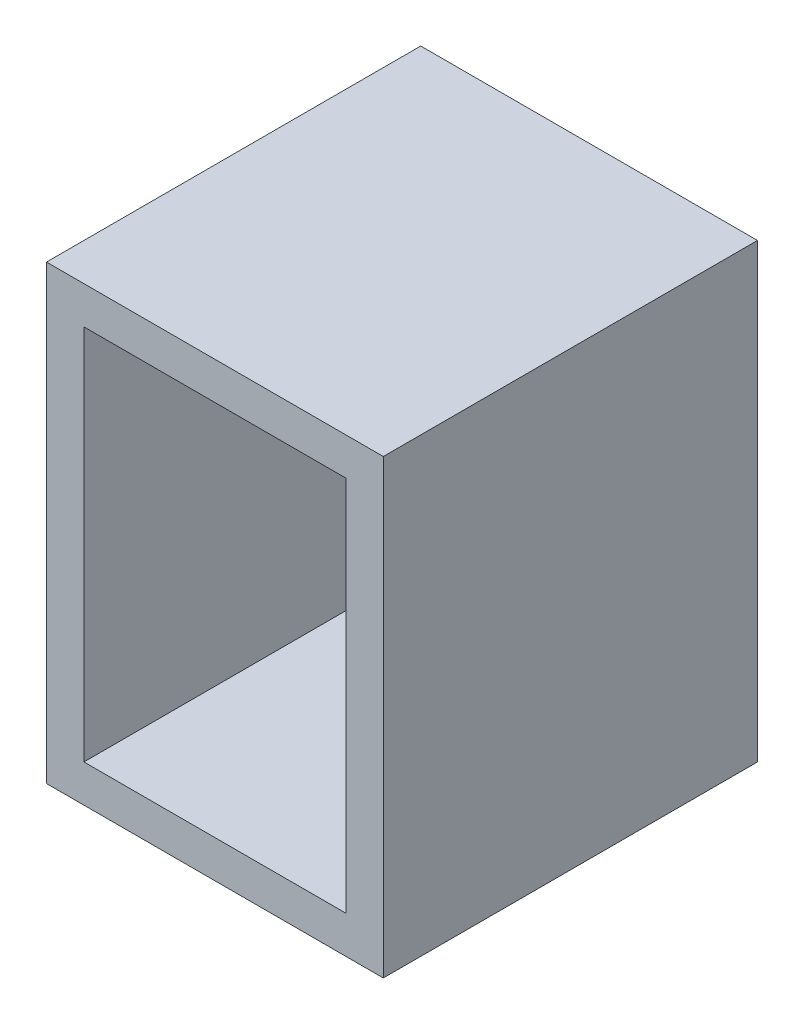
ISO-10303-21;
HEADER;
FILE_DESCRIPTION(('STEP AP214'),'2;1');
FILE_NAME('part.step','',(''),(''),'','','');
FILE_SCHEMA(('AUTOMOTIVE_DESIGN { 1 0 10303 214 1 1 1 1 }'));
ENDSEC;
DATA;
#1=APPLICATION_CONTEXT('core data for automotive mechanical design processes');
#2=APPLICATION_PROTOCOL_DEFINITION('international standard','automotive_design',2000,#1);
#3=PRODUCT_CONTEXT('',#1,'mechanical');
#4=PRODUCT('Part','Part','',(#3));
#5=PRODUCT_RELATED_PRODUCT_CATEGORY('part','',(#4));
#6=PRODUCT_DEFINITION_FORMATION('','',#4);
#7=PRODUCT_DEFINITION_CONTEXT('part definition',#1,'design');
#8=PRODUCT_DEFINITION('design','',#6,#7);
#9=PRODUCT_DEFINITION_SHAPE('','',#8);
#10=(LENGTH_UNIT() NAMED_UNIT(*) SI_UNIT(.MILLI.,.METRE.));
#11=(NAMED_UNIT(*) PLANE_ANGLE_UNIT() SI_UNIT($,.RADIAN.));
#12=(NAMED_UNIT(*) SI_UNIT($,.STERADIAN.) SOLID_ANGLE_UNIT());
#13=UNCERTAINTY_MEASURE_WITH_UNIT(LENGTH_MEASURE(1.E-05),#10,'distance_accuracy_value','');
#14=(GEOMETRIC_REPRESENTATION_CONTEXT(3) GLOBAL_UNCERTAINTY_ASSIGNED_CONTEXT((#13)) GLOBAL_UNIT_ASSIGNED_CONTEXT((#10,
#11,#12)) REPRESENTATION_CONTEXT('',''));
#15=CARTESIAN_POINT('',(0.,0.,0.));
#16=DIRECTION('',(0.,0.,1.));
#17=DIRECTION('',(1.,0.,0.));
#18=AXIS2_PLACEMENT_3D('',#15,#16,#17);
#19=CARTESIAN_POINT('',(-22.5,25.173,25.));
#20=DIRECTION('',(1.,0.,0.));
#21=DIRECTION('',(0.,1.,0.));
#22=AXIS2_PLACEMENT_3D('',#19,#20,#21);
#23=PLANE('',#22);
#24=DIRECTION('',(0.,-1.,0.));
#25=VECTOR('',#24,1.);
#26=CARTESIAN_POINT('',(-22.5,25.173,-25.));
#27=LINE('',#26,#25);
#28=CARTESIAN_POINT('',(-22.5,30.173,-25.));
#29=VERTEX_POINT('',#28);
#30=CARTESIAN_POINT('',(-22.5,-30.173,-25.));
#31=VERTEX_POINT('',#30);
#32=EDGE_CURVE('E118',#29,#31,#27,.T.);
#33=ORIENTED_EDGE('',*,*,#32,.T.);
#34=DIRECTION('',(0.,0.,-1.));
#35=VECTOR('',#34,1.);
#36=CARTESIAN_POINT('',(-22.5,-30.173,25.));
#37=LINE('',#36,#35);
#38=CARTESIAN_POINT('',(-22.5,-30.173,25.));
#39=VERTEX_POINT('',#38);
#40=EDGE_CURVE('E11',#39,#31,#37,.T.);
#41=ORIENTED_EDGE('',*,*,#40,.F.);
#42=DIRECTION('',(0.,-1.,0.));
#43=VECTOR('',#42,1.);
#44=CARTESIAN_POINT('',(-22.5,25.173,25.));
#45=LINE('',#44,#43);
#46=CARTESIAN_POINT('',(-22.5,30.173,25.));
#47=VERTEX_POINT('',#46);
#48=EDGE_CURVE('E152',#47,#39,#45,.T.);
#49=ORIENTED_EDGE('',*,*,#48,.F.);
#50=DIRECTION('',(0.,0.,-1.));
#51=VECTOR('',#50,1.);
#52=CARTESIAN_POINT('',(-22.5,30.173,25.));
#53=LINE('',#52,#51);
#54=EDGE_CURVE('E139',#47,#29,#53,.T.);
#55=ORIENTED_EDGE('',*,*,#54,.T.);
#56=EDGE_LOOP('',(#33,#41,#49,#55));
#57=FACE_BOUND('',#56,.T.);
#58=ADVANCED_FACE('F32',(#57),#23,.F.);
#59=CARTESIAN_POINT('',(-17.5,-30.173,25.));
#60=DIRECTION('',(0.,1.,0.));
#61=DIRECTION('',(-1.,0.,0.));
#62=AXIS2_PLACEMENT_3D('',#59,#60,#61);
#63=PLANE('',#62);
#64=DIRECTION('',(1.,0.,0.));
#65=VECTOR('',#64,1.);
#66=CARTESIAN_POINT('',(-17.5,-30.173,-25.));
#67=LINE('',#66,#65);
#68=CARTESIAN_POINT('',(22.5,-30.173,-25.));
#69=VERTEX_POINT('',#68);
#70=EDGE_CURVE('E149',#31,#69,#67,.T.);
#71=ORIENTED_EDGE('',*,*,#70,.T.);
#72=DIRECTION('',(0.,0.,-1.));
#73=VECTOR('',#72,1.);
#74=CARTESIAN_POINT('',(22.5,-30.173,25.));
#75=LINE('',#74,#73);
#76=CARTESIAN_POINT('',(22.5,-30.173,25.));
#77=VERTEX_POINT('',#76);
#78=EDGE_CURVE('E41',#77,#69,#75,.T.);
#79=ORIENTED_EDGE('',*,*,#78,.F.);
#80=DIRECTION('',(1.,0.,0.));
#81=VECTOR('',#80,1.);
#82=CARTESIAN_POINT('',(-17.5,-30.173,25.));
#83=LINE('',#82,#81);
#84=EDGE_CURVE('E158',#39,#77,#83,.T.);
#85=ORIENTED_EDGE('',*,*,#84,.F.);
#86=ORIENTED_EDGE('',*,*,#40,.T.);
#87=EDGE_LOOP('',(#71,#79,#85,#86));
#88=FACE_BOUND('',#87,.T.);
#89=ADVANCED_FACE('F171',(#88),#63,.F.);
#90=CARTESIAN_POINT('',(22.5,25.173,25.));
#91=DIRECTION('',(-1.,0.,0.));
#92=DIRECTION('',(0.,-1.,0.));
#93=AXIS2_PLACEMENT_3D('',#90,#91,#92);
#94=PLANE('',#93);
#95=DIRECTION('',(0.,1.,0.));
#96=VECTOR('',#95,1.);
#97=CARTESIAN_POINT('',(22.5,25.173,-25.));
#98=LINE('',#97,#96);
#99=CARTESIAN_POINT('',(22.5,30.173,-25.));
#100=VERTEX_POINT('',#99);
#101=EDGE_CURVE('E153',#69,#100,#98,.T.);
#102=ORIENTED_EDGE('',*,*,#101,.T.);
#103=DIRECTION('',(0.,0.,-1.));
#104=VECTOR('',#103,1.);
#105=CARTESIAN_POINT('',(22.5,30.173,25.));
#106=LINE('',#105,#104);
#107=CARTESIAN_POINT('',(22.5,30.173,25.));
#108=VERTEX_POINT('',#107);
#109=EDGE_CURVE('E142',#108,#100,#106,.T.);
#110=ORIENTED_EDGE('',*,*,#109,.F.);
#111=DIRECTION('',(0.,1.,0.));
#112=VECTOR('',#111,1.);
#113=CARTESIAN_POINT('',(22.5,25.173,25.));
#114=LINE('',#113,#112);
#115=EDGE_CURVE('E159',#77,#108,#114,.T.);
#116=ORIENTED_EDGE('',*,*,#115,.F.);
#117=ORIENTED_EDGE('',*,*,#78,.T.);
#118=EDGE_LOOP('',(#102,#110,#116,#117));
#119=FACE_BOUND('',#118,.T.);
#120=ADVANCED_FACE('F175',(#119),#94,.F.);
#121=CARTESIAN_POINT('',(-17.5,30.173,25.));
#122=DIRECTION('',(0.,-1.,0.));
#123=DIRECTION('',(0.,0.,-1.));
#124=AXIS2_PLACEMENT_3D('',#121,#122,#123);
#125=PLANE('',#124);
#126=DIRECTION('',(-1.,0.,0.));
#127=VECTOR('',#126,1.);
#128=CARTESIAN_POINT('',(-17.5,30.173,-25.));
#129=LINE('',#128,#127);
#130=EDGE_CURVE('E150',#100,#29,#129,.T.);
#131=ORIENTED_EDGE('',*,*,#130,.T.);
#132=ORIENTED_EDGE('',*,*,#54,.F.);
#133=DIRECTION('',(-1.,0.,0.));
#134=VECTOR('',#133,1.);
#135=CARTESIAN_POINT('',(-17.5,30.173,25.));
#136=LINE('',#135,#134);
#137=EDGE_CURVE('E36',#108,#47,#136,.T.);
#138=ORIENTED_EDGE('',*,*,#137,.F.);
#139=ORIENTED_EDGE('',*,*,#109,.T.);
#140=EDGE_LOOP('',(#131,#132,#138,#139));
#141=FACE_BOUND('',#140,.T.);
#142=ADVANCED_FACE('F34',(#141),#125,.F.);
#143=CARTESIAN_POINT('',(-17.5,-25.173,25.));
#144=DIRECTION('',(0.,0.,1.));
#145=DIRECTION('',(1.,0.,0.));
#146=AXIS2_PLACEMENT_3D('',#143,#144,#145);
#147=PLANE('',#146);
#148=DIRECTION('',(0.,-1.,0.));
#149=VECTOR('',#148,1.);
#150=CARTESIAN_POINT('',(-17.5,25.173,25.));
#151=LINE('',#150,#149);
#152=CARTESIAN_POINT('',(-17.5,25.173,25.));
#153=VERTEX_POINT('',#152);
#154=CARTESIAN_POINT('',(-17.5,-25.173,25.));
#155=VERTEX_POINT('',#154);
#156=EDGE_CURVE('E101',#153,#155,#151,.T.);
#157=ORIENTED_EDGE('',*,*,#156,.F.);
#158=DIRECTION('',(-1.,0.,0.));
#159=VECTOR('',#158,1.);
#160=CARTESIAN_POINT('',(-17.5,25.173,25.));
#161=LINE('',#160,#159);
#162=CARTESIAN_POINT('',(17.5,25.173,25.));
#163=VERTEX_POINT('',#162);
#164=EDGE_CURVE('E126',#163,#153,#161,.T.);
#165=ORIENTED_EDGE('',*,*,#164,.F.);
#166=DIRECTION('',(0.,1.,0.));
#167=VECTOR('',#166,1.);
#168=CARTESIAN_POINT('',(17.5,25.173,25.));
#169=LINE('',#168,#167);
#170=CARTESIAN_POINT('',(17.5,-25.173,25.));
#171=VERTEX_POINT('',#170);
#172=EDGE_CURVE('E124',#171,#163,#169,.T.);
#173=ORIENTED_EDGE('',*,*,#172,.F.);
#174=DIRECTION('',(1.,0.,0.));
#175=VECTOR('',#174,1.);
#176=CARTESIAN_POINT('',(-17.5,-25.173,25.));
#177=LINE('',#176,#175);
#178=EDGE_CURVE('E111',#155,#171,#177,.T.);
#179=ORIENTED_EDGE('',*,*,#178,.F.);
#180=EDGE_LOOP('',(#157,#165,#173,#179));
#181=FACE_BOUND('',#180,.T.);
#182=ORIENTED_EDGE('',*,*,#48,.T.);
#183=ORIENTED_EDGE('',*,*,#84,.T.);
#184=ORIENTED_EDGE('',*,*,#115,.T.);
#185=ORIENTED_EDGE('',*,*,#137,.T.);
#186=EDGE_LOOP('',(#182,#183,#184,#185));
#187=FACE_BOUND('',#186,.T.);
#188=ADVANCED_FACE('F122',(#181,#187),#147,.T.);
#189=CARTESIAN_POINT('',(-17.5,-25.173,-25.));
#190=DIRECTION('',(0.,0.,1.));
#191=DIRECTION('',(1.,0.,0.));
#192=AXIS2_PLACEMENT_3D('',#189,#190,#191);
#193=PLANE('',#192);
#194=DIRECTION('',(-1.,0.,0.));
#195=VECTOR('',#194,1.);
#196=CARTESIAN_POINT('',(-17.5,25.173,-25.));
#197=LINE('',#196,#195);
#198=CARTESIAN_POINT('',(17.5,25.173,-25.));
#199=VERTEX_POINT('',#198);
#200=CARTESIAN_POINT('',(-17.5,25.173,-25.));
#201=VERTEX_POINT('',#200);
#202=EDGE_CURVE('E112',#199,#201,#197,.T.);
#203=ORIENTED_EDGE('',*,*,#202,.T.);
#204=DIRECTION('',(0.,-1.,0.));
#205=VECTOR('',#204,1.);
#206=CARTESIAN_POINT('',(-17.5,25.173,-25.));
#207=LINE('',#206,#205);
#208=CARTESIAN_POINT('',(-17.5,-25.173,-25.));
#209=VERTEX_POINT('',#208);
#210=EDGE_CURVE('E130',#201,#209,#207,.T.);
#211=ORIENTED_EDGE('',*,*,#210,.T.);
#212=DIRECTION('',(1.,0.,0.));
#213=VECTOR('',#212,1.);
#214=CARTESIAN_POINT('',(-17.5,-25.173,-25.));
#215=LINE('',#214,#213);
#216=CARTESIAN_POINT('',(17.5,-25.173,-25.));
#217=VERTEX_POINT('',#216);
#218=EDGE_CURVE('E117',#209,#217,#215,.T.);
#219=ORIENTED_EDGE('',*,*,#218,.T.);
#220=DIRECTION('',(0.,1.,0.));
#221=VECTOR('',#220,1.);
#222=CARTESIAN_POINT('',(17.5,25.173,-25.));
#223=LINE('',#222,#221);
#224=EDGE_CURVE('E56',#217,#199,#223,.T.);
#225=ORIENTED_EDGE('',*,*,#224,.T.);
#226=EDGE_LOOP('',(#203,#211,#219,#225));
#227=FACE_BOUND('',#226,.T.);
#228=ORIENTED_EDGE('',*,*,#32,.F.);
#229=ORIENTED_EDGE('',*,*,#130,.F.);
#230=ORIENTED_EDGE('',*,*,#101,.F.);
#231=ORIENTED_EDGE('',*,*,#70,.F.);
#232=EDGE_LOOP('',(#228,#229,#230,#231));
#233=FACE_BOUND('',#232,.T.);
#234=ADVANCED_FACE('F177',(#227,#233),#193,.F.);
#235=CARTESIAN_POINT('',(-17.5,25.173,25.));
#236=DIRECTION('',(1.,0.,0.));
#237=DIRECTION('',(0.,1.,0.));
#238=AXIS2_PLACEMENT_3D('',#235,#236,#237);
#239=PLANE('',#238);
#240=ORIENTED_EDGE('',*,*,#210,.F.);
#241=DIRECTION('',(0.,0.,-1.));
#242=VECTOR('',#241,1.);
#243=CARTESIAN_POINT('',(-17.5,25.173,25.));
#244=LINE('',#243,#242);
#245=EDGE_CURVE('E107',#153,#201,#244,.T.);
#246=ORIENTED_EDGE('',*,*,#245,.F.);
#247=ORIENTED_EDGE('',*,*,#156,.T.);
#248=DIRECTION('',(0.,0.,-1.));
#249=VECTOR('',#248,1.);
#250=CARTESIAN_POINT('',(-17.5,-25.173,25.));
#251=LINE('',#250,#249);
#252=EDGE_CURVE('E105',#155,#209,#251,.T.);
#253=ORIENTED_EDGE('',*,*,#252,.T.);
#254=EDGE_LOOP('',(#240,#246,#247,#253));
#255=FACE_BOUND('',#254,.T.);
#256=ADVANCED_FACE('F104',(#255),#239,.T.);
#257=CARTESIAN_POINT('',(-17.5,-25.173,25.));
#258=DIRECTION('',(0.,1.,0.));
#259=DIRECTION('',(-1.,0.,0.));
#260=AXIS2_PLACEMENT_3D('',#257,#258,#259);
#261=PLANE('',#260);
#262=ORIENTED_EDGE('',*,*,#218,.F.);
#263=ORIENTED_EDGE('',*,*,#252,.F.);
#264=ORIENTED_EDGE('',*,*,#178,.T.);
#265=DIRECTION('',(0.,0.,-1.));
#266=VECTOR('',#265,1.);
#267=CARTESIAN_POINT('',(17.5,-25.173,25.));
#268=LINE('',#267,#266);
#269=EDGE_CURVE('E119',#171,#217,#268,.T.);
#270=ORIENTED_EDGE('',*,*,#269,.T.);
#271=EDGE_LOOP('',(#262,#263,#264,#270));
#272=FACE_BOUND('',#271,.T.);
#273=ADVANCED_FACE('F115',(#272),#261,.T.);
#274=CARTESIAN_POINT('',(17.5,25.173,25.));
#275=DIRECTION('',(-1.,0.,0.));
#276=DIRECTION('',(0.,-1.,0.));
#277=AXIS2_PLACEMENT_3D('',#274,#275,#276);
#278=PLANE('',#277);
#279=ORIENTED_EDGE('',*,*,#224,.F.);
#280=ORIENTED_EDGE('',*,*,#269,.F.);
#281=ORIENTED_EDGE('',*,*,#172,.T.);
#282=DIRECTION('',(0.,0.,-1.));
#283=VECTOR('',#282,1.);
#284=CARTESIAN_POINT('',(17.5,25.173,25.));
#285=LINE('',#284,#283);
#286=EDGE_CURVE('E49',#163,#199,#285,.T.);
#287=ORIENTED_EDGE('',*,*,#286,.T.);
#288=EDGE_LOOP('',(#279,#280,#281,#287));
#289=FACE_BOUND('',#288,.T.);
#290=ADVANCED_FACE('F222',(#289),#278,.T.);
#291=CARTESIAN_POINT('',(-17.5,25.173,25.));
#292=DIRECTION('',(0.,-1.,0.));
#293=DIRECTION('',(0.,0.,-1.));
#294=AXIS2_PLACEMENT_3D('',#291,#292,#293);
#295=PLANE('',#294);
#296=ORIENTED_EDGE('',*,*,#202,.F.);
#297=ORIENTED_EDGE('',*,*,#286,.F.);
#298=ORIENTED_EDGE('',*,*,#164,.T.);
#299=ORIENTED_EDGE('',*,*,#245,.T.);
#300=EDGE_LOOP('',(#296,#297,#298,#299));
#301=FACE_BOUND('',#300,.T.);
#302=ADVANCED_FACE('F231',(#301),#295,.T.);
#303=CLOSED_SHELL('',(#58,#89,#120,#142,#188,#234,#256,#273,#290,#302));
#304=MANIFOLD_SOLID_BREP('B2',#303);
#305=ADVANCED_BREP_SHAPE_REPRESENTATION('',(#18,#304),#14);
#306=SHAPE_DEFINITION_REPRESENTATION(#9,#305);
ENDSEC;
END-ISO-10303-21;
